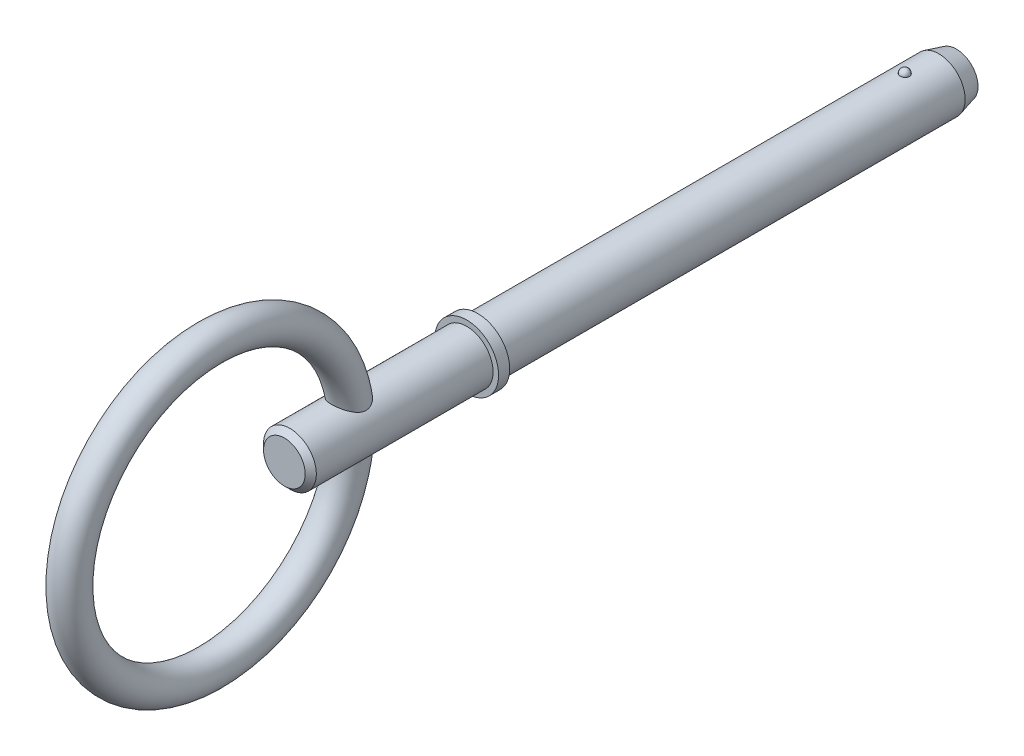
ISO-10303-21;
HEADER;
FILE_DESCRIPTION(('STEP AP214'),'2;1');
FILE_NAME('part.step','',(''),(''),'','','');
FILE_SCHEMA(('AUTOMOTIVE_DESIGN { 1 0 10303 214 1 1 1 1 }'));
ENDSEC;
DATA;
#1=APPLICATION_CONTEXT('core data for automotive mechanical design processes');
#2=APPLICATION_PROTOCOL_DEFINITION('international standard','automotive_design',2000,#1);
#3=PRODUCT_CONTEXT('',#1,'mechanical');
#4=PRODUCT('Part','Part','',(#3));
#5=PRODUCT_RELATED_PRODUCT_CATEGORY('part','',(#4));
#6=PRODUCT_DEFINITION_FORMATION('','',#4);
#7=PRODUCT_DEFINITION_CONTEXT('part definition',#1,'design');
#8=PRODUCT_DEFINITION('design','',#6,#7);
#9=PRODUCT_DEFINITION_SHAPE('','',#8);
#10=(LENGTH_UNIT() NAMED_UNIT(*) SI_UNIT(.MILLI.,.METRE.));
#11=(NAMED_UNIT(*) PLANE_ANGLE_UNIT() SI_UNIT($,.RADIAN.));
#12=(NAMED_UNIT(*) SI_UNIT($,.STERADIAN.) SOLID_ANGLE_UNIT());
#13=UNCERTAINTY_MEASURE_WITH_UNIT(LENGTH_MEASURE(1.E-05),#10,'distance_accuracy_value','');
#14=(GEOMETRIC_REPRESENTATION_CONTEXT(3) GLOBAL_UNCERTAINTY_ASSIGNED_CONTEXT((#13)) GLOBAL_UNIT_ASSIGNED_CONTEXT((#10,
#11,#12)) REPRESENTATION_CONTEXT('',''));
#15=CARTESIAN_POINT('',(0.,0.,0.));
#16=DIRECTION('',(0.,0.,1.));
#17=DIRECTION('',(1.,0.,0.));
#18=AXIS2_PLACEMENT_3D('',#15,#16,#17);
#19=CARTESIAN_POINT('',(0.,0.,38.1));
#20=DIRECTION('',(0.,0.,-1.));
#21=DIRECTION('',(-1.,0.,0.));
#22=AXIS2_PLACEMENT_3D('',#19,#20,#21);
#23=CYLINDRICAL_SURFACE('',#22,2.38);
#24=CARTESIAN_POINT('',(0.418361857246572,2.34294117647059,-0.419999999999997));
#25=CARTESIAN_POINT('',(0.418361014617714,2.34294160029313,-0.396453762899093));
#26=CARTESIAN_POINT('',(0.416399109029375,2.34329426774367,-0.372895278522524));
#27=CARTESIAN_POINT('',(0.408599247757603,2.34466666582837,-0.32643458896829));
#28=CARTESIAN_POINT('',(0.402757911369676,2.34568697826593,-0.303532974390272));
#29=CARTESIAN_POINT('',(0.387358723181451,2.3482789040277,-0.259059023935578));
#30=CARTESIAN_POINT('',(0.377802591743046,2.34985026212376,-0.237486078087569));
#31=CARTESIAN_POINT('',(0.355233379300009,2.35336760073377,-0.196270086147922));
#32=CARTESIAN_POINT('',(0.342220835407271,2.3553135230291,-0.176626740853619));
#33=CARTESIAN_POINT('',(0.313060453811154,2.35936636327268,-0.139777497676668));
#34=CARTESIAN_POINT('',(0.296906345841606,2.36147359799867,-0.122576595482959));
#35=CARTESIAN_POINT('',(0.26192116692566,2.36560920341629,-0.0911421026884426));
#36=CARTESIAN_POINT('',(0.243090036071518,2.36763757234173,-0.0769085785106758));
#37=CARTESIAN_POINT('',(0.203297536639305,2.37138533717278,-0.0518262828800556));
#38=CARTESIAN_POINT('',(0.182338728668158,2.37310509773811,-0.0409735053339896));
#39=CARTESIAN_POINT('',(0.138864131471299,2.37604521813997,-0.0229395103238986));
#40=CARTESIAN_POINT('',(0.116348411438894,2.37726560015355,-0.015758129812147));
#41=CARTESIAN_POINT('',(0.0705754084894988,2.37906276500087,-0.0053120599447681));
#42=CARTESIAN_POINT('',(0.0473247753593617,2.37964420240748,-0.00201903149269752));
#43=CARTESIAN_POINT('',(0.000593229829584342,2.38011460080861,0.000651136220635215));
#44=CARTESIAN_POINT('',(-0.0228876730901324,2.38000359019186,2.84360175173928E-05));
#45=CARTESIAN_POINT('',(-0.0692686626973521,2.37910422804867,-0.0050994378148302));
#46=CARTESIAN_POINT('',(-0.092171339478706,2.37831983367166,-0.00958192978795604));
#47=CARTESIAN_POINT('',(-0.136890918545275,2.37616546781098,-0.0222720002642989));
#48=CARTESIAN_POINT('',(-0.158707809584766,2.37479549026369,-0.0304796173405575));
#49=CARTESIAN_POINT('',(-0.200704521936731,2.37161607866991,-0.0504168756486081));
#50=CARTESIAN_POINT('',(-0.220879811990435,2.36980547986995,-0.0621558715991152));
#51=CARTESIAN_POINT('',(-0.258974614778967,2.36594575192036,-0.0888218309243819));
#52=CARTESIAN_POINT('',(-0.276894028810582,2.36389661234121,-0.103748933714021));
#53=CARTESIAN_POINT('',(-0.310124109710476,2.35976825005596,-0.136509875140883));
#54=CARTESIAN_POINT('',(-0.325413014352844,2.35768891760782,-0.154365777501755));
#55=CARTESIAN_POINT('',(-0.352793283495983,2.35374782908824,-0.192402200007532));
#56=CARTESIAN_POINT('',(-0.364884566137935,2.35188607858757,-0.212582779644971));
#57=CARTESIAN_POINT('',(-0.385587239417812,2.34858114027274,-0.254794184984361));
#58=CARTESIAN_POINT('',(-0.394183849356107,2.34713973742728,-0.276832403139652));
#59=CARTESIAN_POINT('',(-0.407590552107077,2.3448489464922,-0.322061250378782));
#60=CARTESIAN_POINT('',(-0.412400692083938,2.34399955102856,-0.34525186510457));
#61=CARTESIAN_POINT('',(-0.418098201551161,2.34299005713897,-0.392078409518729));
#62=CARTESIAN_POINT('',(-0.41899328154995,2.34282860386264,-0.415713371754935));
#63=CARTESIAN_POINT('',(-0.416857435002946,2.34320955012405,-0.462799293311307));
#64=CARTESIAN_POINT('',(-0.413826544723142,2.34375194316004,-0.486250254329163));
#65=CARTESIAN_POINT('',(-0.403929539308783,2.34547773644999,-0.532261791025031));
#66=CARTESIAN_POINT('',(-0.397069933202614,2.34666004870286,-0.554823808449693));
#67=CARTESIAN_POINT('',(-0.379705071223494,2.34953208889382,-0.59846383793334));
#68=CARTESIAN_POINT('',(-0.369199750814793,2.35122182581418,-0.619541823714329));
#69=CARTESIAN_POINT('',(-0.34479732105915,2.35492396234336,-0.659671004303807));
#70=CARTESIAN_POINT('',(-0.33089223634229,2.35693711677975,-0.678717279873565));
#71=CARTESIAN_POINT('',(-0.300080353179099,2.36105754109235,-0.714192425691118));
#72=CARTESIAN_POINT('',(-0.283173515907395,2.36316481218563,-0.730621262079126));
#73=CARTESIAN_POINT('',(-0.246801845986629,2.36723962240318,-0.760416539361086));
#74=CARTESIAN_POINT('',(-0.227334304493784,2.36920701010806,-0.773779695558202));
#75=CARTESIAN_POINT('',(-0.186398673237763,2.37277833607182,-0.797042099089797));
#76=CARTESIAN_POINT('',(-0.164930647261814,2.37438228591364,-0.806941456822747));
#77=CARTESIAN_POINT('',(-0.120727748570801,2.37703848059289,-0.82294821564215));
#78=CARTESIAN_POINT('',(-0.0980005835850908,2.37809374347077,-0.829076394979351));
#79=CARTESIAN_POINT('',(-0.051821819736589,2.37954782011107,-0.837451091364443));
#80=CARTESIAN_POINT('',(-0.0283702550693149,2.37994666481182,-0.839697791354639));
#81=CARTESIAN_POINT('',(0.0184023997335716,2.38004290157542,-0.840243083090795));
#82=CARTESIAN_POINT('',(0.0417231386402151,2.37974556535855,-0.838571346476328));
#83=CARTESIAN_POINT('',(0.0877471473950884,2.37849333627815,-0.831389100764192));
#84=CARTESIAN_POINT('',(0.110450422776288,2.37753844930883,-0.825878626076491));
#85=CARTESIAN_POINT('',(0.154584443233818,2.37507730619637,-0.811179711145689));
#86=CARTESIAN_POINT('',(0.17601599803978,2.37357140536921,-0.801993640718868));
#87=CARTESIAN_POINT('',(0.217028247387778,2.37017355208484,-0.780200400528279));
#88=CARTESIAN_POINT('',(0.236608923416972,2.36828159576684,-0.767593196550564));
#89=CARTESIAN_POINT('',(0.27351405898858,2.36430486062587,-0.739207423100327));
#90=CARTESIAN_POINT('',(0.290821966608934,2.36221883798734,-0.723407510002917));
#91=CARTESIAN_POINT('',(0.322554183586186,2.3580957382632,-0.689126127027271));
#92=CARTESIAN_POINT('',(0.336977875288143,2.35605867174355,-0.670644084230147));
#93=CARTESIAN_POINT('',(0.362636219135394,2.35224677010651,-0.63138169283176));
#94=CARTESIAN_POINT('',(0.373848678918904,2.35047379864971,-0.610586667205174));
#95=CARTESIAN_POINT('',(0.392641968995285,2.34740786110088,-0.567397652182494));
#96=CARTESIAN_POINT('',(0.400225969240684,2.34611447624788,-0.545005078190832));
#97=CARTESIAN_POINT('',(0.410033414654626,2.34441668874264,-0.505456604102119));
#98=CARTESIAN_POINT('',(0.413152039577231,2.34386644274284,-0.488523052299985));
#99=CARTESIAN_POINT('',(0.417316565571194,2.34312853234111,-0.454395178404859));
#100=CARTESIAN_POINT('',(0.418362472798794,2.34294086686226,-0.43720085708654));
#101=CARTESIAN_POINT('',(0.418361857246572,2.34294117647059,-0.419999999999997));
#102=B_SPLINE_CURVE_WITH_KNOTS('',3,(#24,#25,#26,#27,#28,#29,#30,#31,#32,#33,#34,#35,#36,#37,
#38,#39,#40,#41,#42,#43,#44,#45,#46,#47,#48,#49,#50,#51,#52,#53,#54,#55,#56,#57,#58,#59,#60,#61,
#62,#63,#64,#65,#66,#67,#68,#69,#70,#71,#72,#73,#74,#75,#76,#77,#78,#79,#80,#81,#82,#83,#84,#85,
#86,#87,#88,#89,#90,#91,#92,#93,#94,#95,#96,#97,#98,#99,#100,#101),.UNSPECIFIED.,.T.,.F.,(4,2,2,
2,2,2,2,2,2,2,2,2,2,2,2,2,2,2,2,2,2,2,2,2,2,2,2,2,2,2,2,2,2,2,2,2,2,2,4),(0.,0.0705763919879,
0.141214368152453,0.211819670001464,0.282414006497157,0.353150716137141,0.423889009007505,
0.494543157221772,0.565194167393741,0.635327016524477,0.705456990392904,0.77517764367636,
0.844899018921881,0.914806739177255,0.98471751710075,1.05518143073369,1.1256471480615,
1.19640787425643,1.26716771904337,1.33778814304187,1.40840791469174,1.47890799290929,
1.54940931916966,1.62007764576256,1.69074688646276,1.76149149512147,1.83223384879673,
1.90258285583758,1.97292854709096,2.04274328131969,2.11255738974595,2.18232655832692,
2.25209642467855,2.32234913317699,2.39261687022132,2.4633591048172,2.5340394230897,
2.58559662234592,2.63715366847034),.UNSPECIFIED.);
#103=CARTESIAN_POINT('',(0.418361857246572,2.34294117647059,-0.419999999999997));
#104=VERTEX_POINT('',#103);
#105=EDGE_CURVE('E102',#104,#104,#102,.T.);
#106=ORIENTED_EDGE('',*,*,#105,.T.);
#107=EDGE_LOOP('',(#106));
#108=FACE_BOUND('',#107,.T.);
#109=CARTESIAN_POINT('',(0.,0.,-3.49400000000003));
#110=DIRECTION('',(0.,0.,-1.));
#111=DIRECTION('',(-1.,0.,0.));
#112=AXIS2_PLACEMENT_3D('',#109,#110,#111);
#113=CIRCLE('',#112,2.38);
#114=CARTESIAN_POINT('',(-2.38,0.,-3.49400000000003));
#115=VERTEX_POINT('',#114);
#116=EDGE_CURVE('E109',#115,#115,#113,.F.);
#117=ORIENTED_EDGE('',*,*,#116,.T.);
#118=EDGE_LOOP('',(#117));
#119=FACE_BOUND('',#118,.T.);
#120=CARTESIAN_POINT('',(0.,0.,38.1));
#121=DIRECTION('',(0.,0.,1.));
#122=DIRECTION('',(1.,0.,0.));
#123=AXIS2_PLACEMENT_3D('',#120,#121,#122);
#124=CIRCLE('',#123,2.38);
#125=CARTESIAN_POINT('',(2.38,0.,38.1));
#126=VERTEX_POINT('',#125);
#127=EDGE_CURVE('E107',#126,#126,#124,.T.);
#128=ORIENTED_EDGE('',*,*,#127,.F.);
#129=EDGE_LOOP('',(#128));
#130=FACE_BOUND('',#129,.T.);
#131=ADVANCED_FACE('F39',(#108,#119,#130),#23,.T.);
#132=CARTESIAN_POINT('',(0.,0.,-5.08));
#133=DIRECTION('',(0.,0.,-1.));
#134=DIRECTION('',(-1.,0.,0.));
#135=AXIS2_PLACEMENT_3D('',#132,#133,#134);
#136=PLANE('',#135);
#137=CARTESIAN_POINT('',(0.,0.,-5.08));
#138=DIRECTION('',(0.,0.,-1.));
#139=DIRECTION('',(-1.,0.,0.));
#140=AXIS2_PLACEMENT_3D('',#137,#138,#139);
#141=CIRCLE('',#140,1.95503258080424);
#142=CARTESIAN_POINT('',(-1.95503258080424,0.,-5.08));
#143=VERTEX_POINT('',#142);
#144=EDGE_CURVE('E143',#143,#143,#141,.T.);
#145=ORIENTED_EDGE('',*,*,#144,.T.);
#146=EDGE_LOOP('',(#145));
#147=FACE_BOUND('',#146,.T.);
#148=ADVANCED_FACE('F88',(#147),#136,.T.);
#149=CARTESIAN_POINT('',(0.,0.,-5.08));
#150=DIRECTION('',(0.,0.,1.));
#151=DIRECTION('',(1.,0.,0.));
#152=AXIS2_PLACEMENT_3D('',#149,#150,#151);
#153=CONICAL_SURFACE('',#152,1.95503258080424,0.261799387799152);
#154=ORIENTED_EDGE('',*,*,#116,.F.);
#155=EDGE_LOOP('',(#154));
#156=FACE_BOUND('',#155,.T.);
#157=ORIENTED_EDGE('',*,*,#144,.F.);
#158=EDGE_LOOP('',(#157));
#159=FACE_BOUND('',#158,.T.);
#160=ADVANCED_FACE('F94',(#156,#159),#153,.T.);
#161=CARTESIAN_POINT('',(0.,2.38,-0.419999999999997));
#162=DIRECTION('',(0.,1.,0.));
#163=DIRECTION('',(0.,0.,1.));
#164=AXIS2_PLACEMENT_3D('',#161,#162,#163);
#165=SPHERICAL_SURFACE('',#164,0.419999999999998);
#166=ORIENTED_EDGE('',*,*,#105,.F.);
#167=EDGE_LOOP('',(#166));
#168=FACE_BOUND('',#167,.T.);
#169=ADVANCED_FACE('F112',(#168),#165,.T.);
#170=CARTESIAN_POINT('',(0.,0.,38.1));
#171=DIRECTION('',(0.,0.,-1.));
#172=DIRECTION('',(-1.,0.,0.));
#173=AXIS2_PLACEMENT_3D('',#170,#171,#172);
#174=PLANE('',#173);
#175=ORIENTED_EDGE('',*,*,#127,.T.);
#176=EDGE_LOOP('',(#175));
#177=FACE_BOUND('',#176,.T.);
#178=CARTESIAN_POINT('',(0.,0.,38.1));
#179=DIRECTION('',(0.,0.,-1.));
#180=DIRECTION('',(-1.,0.,0.));
#181=AXIS2_PLACEMENT_3D('',#178,#179,#180);
#182=CIRCLE('',#181,2.88);
#183=CARTESIAN_POINT('',(-2.88,0.,38.1));
#184=VERTEX_POINT('',#183);
#185=EDGE_CURVE('E108',#184,#184,#182,.T.);
#186=ORIENTED_EDGE('',*,*,#185,.T.);
#187=EDGE_LOOP('',(#186));
#188=FACE_BOUND('',#187,.T.);
#189=ADVANCED_FACE('F116',(#177,#188),#174,.T.);
#190=CARTESIAN_POINT('',(0.,0.,33.7287874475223));
#191=DIRECTION('',(0.,0.,-1.));
#192=DIRECTION('',(-1.,0.,0.));
#193=AXIS2_PLACEMENT_3D('',#190,#191,#192);
#194=CYLINDRICAL_SURFACE('',#193,2.88);
#195=CARTESIAN_POINT('',(0.,0.,39.1));
#196=DIRECTION('',(0.,0.,-1.));
#197=DIRECTION('',(-1.,0.,0.));
#198=AXIS2_PLACEMENT_3D('',#195,#196,#197);
#199=CIRCLE('',#198,2.88);
#200=CARTESIAN_POINT('',(-2.88,0.,39.1));
#201=VERTEX_POINT('',#200);
#202=EDGE_CURVE('E133',#201,#201,#199,.T.);
#203=ORIENTED_EDGE('',*,*,#202,.T.);
#204=EDGE_LOOP('',(#203));
#205=FACE_BOUND('',#204,.T.);
#206=ORIENTED_EDGE('',*,*,#185,.F.);
#207=EDGE_LOOP('',(#206));
#208=FACE_BOUND('',#207,.T.);
#209=ADVANCED_FACE('F120',(#205,#208),#194,.T.);
#210=CARTESIAN_POINT('',(0.,2.88,39.1));
#211=DIRECTION('',(0.,0.,1.));
#212=DIRECTION('',(1.,0.,0.));
#213=AXIS2_PLACEMENT_3D('',#210,#211,#212);
#214=PLANE('',#213);
#215=CARTESIAN_POINT('',(0.,0.,39.1));
#216=DIRECTION('',(0.,0.,1.));
#217=DIRECTION('',(1.,0.,0.));
#218=AXIS2_PLACEMENT_3D('',#215,#216,#217);
#219=CIRCLE('',#218,2.38);
#220=CARTESIAN_POINT('',(2.38,0.,39.1));
#221=VERTEX_POINT('',#220);
#222=EDGE_CURVE('E111',#221,#221,#219,.T.);
#223=ORIENTED_EDGE('',*,*,#222,.F.);
#224=EDGE_LOOP('',(#223));
#225=FACE_BOUND('',#224,.T.);
#226=ORIENTED_EDGE('',*,*,#202,.F.);
#227=EDGE_LOOP('',(#226));
#228=FACE_BOUND('',#227,.T.);
#229=ADVANCED_FACE('F85',(#225,#228),#214,.T.);
#230=CARTESIAN_POINT('',(0.,0.,55.55));
#231=DIRECTION('',(0.,0.,-1.));
#232=DIRECTION('',(-1.,0.,0.));
#233=AXIS2_PLACEMENT_3D('',#230,#231,#232);
#234=CYLINDRICAL_SURFACE('',#233,2.38);
#235=CARTESIAN_POINT('',(-0.903407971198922,-2.20187511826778,48.528101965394));
#236=CARTESIAN_POINT('',(-0.839710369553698,-2.22800560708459,48.4836275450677));
#237=CARTESIAN_POINT('',(-0.771955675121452,-2.25255828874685,48.4439200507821));
#238=CARTESIAN_POINT('',(-0.629623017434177,-2.29641711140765,48.3749006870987));
#239=CARTESIAN_POINT('',(-0.555034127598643,-2.31571464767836,48.3456058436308));
#240=CARTESIAN_POINT('',(-0.400673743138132,-2.34735542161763,48.2982943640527));
#241=CARTESIAN_POINT('',(-0.320887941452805,-2.35967847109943,48.2803104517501));
#242=CARTESIAN_POINT('',(-0.158738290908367,-2.37609587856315,48.2564617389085));
#243=CARTESIAN_POINT('',(-0.0763765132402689,-2.38019668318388,48.2505874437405));
#244=CARTESIAN_POINT('',(0.0836658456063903,-2.3797998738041,48.2511603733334));
#245=CARTESIAN_POINT('',(0.161351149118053,-2.37576936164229,48.2569382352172));
#246=CARTESIAN_POINT('',(0.314409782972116,-2.36039486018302,48.2792676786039));
#247=CARTESIAN_POINT('',(0.389782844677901,-2.34905002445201,48.2958205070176));
#248=CARTESIAN_POINT('',(0.535937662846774,-2.32006569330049,48.3390515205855));
#249=CARTESIAN_POINT('',(0.606735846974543,-2.30245039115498,48.3656908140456));
#250=CARTESIAN_POINT('',(0.742521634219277,-2.26231731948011,48.4283720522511));
#251=CARTESIAN_POINT('',(0.807508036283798,-2.23979853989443,48.4644159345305));
#252=CARTESIAN_POINT('',(0.935326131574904,-2.18966592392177,48.5483563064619));
#253=CARTESIAN_POINT('',(0.997591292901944,-2.16179128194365,48.5969595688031));
#254=CARTESIAN_POINT('',(1.11292144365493,-2.10474548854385,48.7035603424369));
#255=CARTESIAN_POINT('',(1.16597568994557,-2.07557287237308,48.7615686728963));
#256=CARTESIAN_POINT('',(1.26477130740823,-2.01699124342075,48.8902977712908));
#257=CARTESIAN_POINT('',(1.30983402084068,-1.98768494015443,48.9615920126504));
#258=CARTESIAN_POINT('',(1.38660631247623,-1.93491744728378,49.1129637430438));
#259=CARTESIAN_POINT('',(1.41834090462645,-1.91144534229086,49.1930244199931));
#260=CARTESIAN_POINT('',(1.46422131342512,-1.8764884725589,49.3506940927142));
#261=CARTESIAN_POINT('',(1.47990731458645,-1.86397592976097,49.4276190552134));
#262=CARTESIAN_POINT('',(1.49871691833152,-1.84889326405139,49.5838974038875));
#263=CARTESIAN_POINT('',(1.50185388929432,-1.84631256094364,49.6632481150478));
#264=CARTESIAN_POINT('',(1.4964844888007,-1.85065563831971,49.8088470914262));
#265=CARTESIAN_POINT('',(1.48970686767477,-1.85616871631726,49.8752204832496));
#266=CARTESIAN_POINT('',(1.46828795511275,-1.87315650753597,50.0059075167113));
#267=CARTESIAN_POINT('',(1.4536391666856,-1.88463690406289,50.0702191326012));
#268=CARTESIAN_POINT('',(1.40943250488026,-1.91806137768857,50.2230643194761));
#269=CARTESIAN_POINT('',(1.37616344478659,-1.94238425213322,50.3099991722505));
#270=CARTESIAN_POINT('',(1.29708737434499,-1.99605834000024,50.4763485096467));
#271=CARTESIAN_POINT('',(1.25125268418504,-2.02542060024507,50.555745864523));
#272=CARTESIAN_POINT('',(1.14695036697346,-2.08629729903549,50.7076285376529));
#273=CARTESIAN_POINT('',(1.08823347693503,-2.11784433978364,50.7799296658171));
#274=CARTESIAN_POINT('',(0.959228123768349,-2.17930599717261,50.9140708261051));
#275=CARTESIAN_POINT('',(0.888958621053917,-2.20922318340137,50.9759276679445));
#276=CARTESIAN_POINT('',(0.75336836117,-2.25851185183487,51.0749333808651));
#277=CARTESIAN_POINT('',(0.690173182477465,-2.27877299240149,51.1145392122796));
#278=CARTESIAN_POINT('',(0.557409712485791,-2.31482439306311,51.1839846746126));
#279=CARTESIAN_POINT('',(0.487846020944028,-2.33061784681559,51.2138312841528));
#280=CARTESIAN_POINT('',(0.342953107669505,-2.35631858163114,51.2620255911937));
#281=CARTESIAN_POINT('',(0.267574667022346,-2.36616750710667,51.280259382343));
#282=CARTESIAN_POINT('',(0.114199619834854,-2.37849775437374,51.3030468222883));
#283=CARTESIAN_POINT('',(0.036205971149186,-2.3809871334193,51.3076154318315));
#284=CARTESIAN_POINT('',(-0.107568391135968,-2.37849121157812,51.3030163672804));
#285=CARTESIAN_POINT('',(-0.173440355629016,-2.37456249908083,51.295790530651));
#286=CARTESIAN_POINT('',(-0.302853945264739,-2.36154811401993,51.2716908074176));
#287=CARTESIAN_POINT('',(-0.366395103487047,-2.35246141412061,51.2548149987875));
#288=CARTESIAN_POINT('',(-0.489880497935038,-2.32988758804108,51.2124346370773));
#289=CARTESIAN_POINT('',(-0.54981278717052,-2.31638670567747,51.1869031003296));
#290=CARTESIAN_POINT('',(-0.665021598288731,-2.28597979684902,51.1284893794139));
#291=CARTESIAN_POINT('',(-0.720295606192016,-2.26907194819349,51.0956032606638));
#292=CARTESIAN_POINT('',(-0.851132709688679,-2.22413718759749,51.0063110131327));
#293=CARTESIAN_POINT('',(-0.923680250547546,-2.19467168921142,50.9461969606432));
#294=CARTESIAN_POINT('',(-1.0572291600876,-2.13356097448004,50.8150668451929));
#295=CARTESIAN_POINT('',(-1.11820078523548,-2.1019104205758,50.7440235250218));
#296=CARTESIAN_POINT('',(-1.22894457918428,-2.03916543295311,50.5916118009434));
#297=CARTESIAN_POINT('',(-1.27853191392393,-2.0080868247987,50.5101025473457));
#298=CARTESIAN_POINT('',(-1.36422650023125,-1.95088121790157,50.3387530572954));
#299=CARTESIAN_POINT('',(-1.4003623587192,-1.92474376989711,50.2489310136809));
#300=CARTESIAN_POINT('',(-1.44943039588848,-1.88791548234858,50.0877392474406));
#301=CARTESIAN_POINT('',(-1.46600167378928,-1.87495651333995,50.0180059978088));
#302=CARTESIAN_POINT('',(-1.48984634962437,-1.8560704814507,49.8760551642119));
#303=CARTESIAN_POINT('',(-1.49713400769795,-1.85013263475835,49.803841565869));
#304=CARTESIAN_POINT('',(-1.5014924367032,-1.84660099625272,49.6583634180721));
#305=CARTESIAN_POINT('',(-1.49849436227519,-1.84906342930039,49.5850950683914));
#306=CARTESIAN_POINT('',(-1.48179888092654,-1.8624661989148,49.4405680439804));
#307=CARTESIAN_POINT('',(-1.46809860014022,-1.87340881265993,49.369309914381));
#308=CARTESIAN_POINT('',(-1.43218989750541,-1.90096973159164,49.2372815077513));
#309=CARTESIAN_POINT('',(-1.410850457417,-1.91699396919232,49.1761429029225));
#310=CARTESIAN_POINT('',(-1.36038958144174,-1.95312601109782,49.0584385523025));
#311=CARTESIAN_POINT('',(-1.33126141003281,-1.97323734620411,49.0018768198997));
#312=CARTESIAN_POINT('',(-1.26173108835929,-2.0185059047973,48.8870500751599));
#313=CARTESIAN_POINT('',(-1.22036168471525,-2.04397945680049,48.8294985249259));
#314=CARTESIAN_POINT('',(-1.1295425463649,-2.09553139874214,48.7216488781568));
#315=CARTESIAN_POINT('',(-1.08010424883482,-2.12160888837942,48.6713407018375));
#316=CARTESIAN_POINT('',(-0.987769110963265,-2.16578285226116,48.5904848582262));
#317=CARTESIAN_POINT('',(-0.946517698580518,-2.18419033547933,48.5582016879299));
#318=CARTESIAN_POINT('',(-0.903407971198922,-2.20187511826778,48.528101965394));
#319=B_SPLINE_CURVE_WITH_KNOTS('',3,(#235,#236,#237,#238,#239,#240,#241,#242,#243,#244,#245,
#246,#247,#248,#249,#250,#251,#252,#253,#254,#255,#256,#257,#258,#259,#260,#261,#262,#263,#264,
#265,#266,#267,#268,#269,#270,#271,#272,#273,#274,#275,#276,#277,#278,#279,#280,#281,#282,#283,
#284,#285,#286,#287,#288,#289,#290,#291,#292,#293,#294,#295,#296,#297,#298,#299,#300,#301,#302,
#303,#304,#305,#306,#307,#308,#309,#310,#311,#312,#313,#314,#315,#316,#317,#318),.UNSPECIFIED.,
.T.,.F.,(4,2,2,2,2,2,2,2,2,2,2,2,2,2,2,2,2,2,2,2,2,2,2,2,2,2,2,2,2,2,2,2,2,2,2,2,2,2,2,2,2,4),
(0.,0.245727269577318,0.491854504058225,0.738690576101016,0.985333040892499,1.21821047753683,
1.45111486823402,1.68313021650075,1.91519340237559,2.16541572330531,2.41592795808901,
2.68235417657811,2.94827811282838,3.18521517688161,3.42189976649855,3.62191159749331,
3.82211427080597,4.10918949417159,4.39690224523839,4.69076958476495,4.98415935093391,
5.21515577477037,5.44598665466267,5.67904815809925,5.91185441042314,6.11003726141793,
6.30825959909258,6.50710565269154,6.70605834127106,7.00062466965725,7.29593791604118,
7.59575158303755,7.89492395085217,8.11262207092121,8.32998539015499,8.54880641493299,
8.76768621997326,8.96702101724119,9.1665287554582,9.39164791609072,9.61645071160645,
9.78275580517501),.UNSPECIFIED.);
#320=CARTESIAN_POINT('',(-0.903407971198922,-2.20187511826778,48.528101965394));
#321=VERTEX_POINT('',#320);
#322=EDGE_CURVE('E10',#321,#321,#319,.T.);
#323=ORIENTED_EDGE('',*,*,#322,.F.);
#324=EDGE_LOOP('',(#323));
#325=FACE_BOUND('',#324,.T.);
#326=CARTESIAN_POINT('',(-0.903407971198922,2.20187511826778,48.528101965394));
#327=CARTESIAN_POINT('',(-0.970214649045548,2.17445928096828,48.5747550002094));
#328=CARTESIAN_POINT('',(-1.03268838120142,2.14525344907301,48.6267440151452));
#329=CARTESIAN_POINT('',(-1.1477077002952,2.0859961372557,48.7406478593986));
#330=CARTESIAN_POINT('',(-1.20022114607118,2.05594226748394,48.8025936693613));
#331=CARTESIAN_POINT('',(-1.29411550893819,1.99817720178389,48.9359266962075));
#332=CARTESIAN_POINT('',(-1.33544720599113,1.9704767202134,49.0073536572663));
#333=CARTESIAN_POINT('',(-1.40506760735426,1.92146090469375,49.1582024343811));
#334=CARTESIAN_POINT('',(-1.43339046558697,1.90012890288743,49.2376026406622));
#335=CARTESIAN_POINT('',(-1.47338334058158,1.86925714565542,49.3934496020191));
#336=CARTESIAN_POINT('',(-1.48649837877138,1.85870842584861,49.4693198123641));
#337=CARTESIAN_POINT('',(-1.50071746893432,1.8472518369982,49.62287045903));
#338=CARTESIAN_POINT('',(-1.50182784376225,1.84633889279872,49.7005499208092));
#339=CARTESIAN_POINT('',(-1.49326645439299,1.85325786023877,49.843985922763));
#340=CARTESIAN_POINT('',(-1.48506604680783,1.85989666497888,49.909904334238));
#341=CARTESIAN_POINT('',(-1.46099386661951,1.87886395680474,50.0394790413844));
#342=CARTESIAN_POINT('',(-1.44511553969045,1.8911973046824,50.1031333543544));
#343=CARTESIAN_POINT('',(-1.39754250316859,1.92678855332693,50.2561538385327));
#344=CARTESIAN_POINT('',(-1.36192725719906,1.95245999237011,50.3437372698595));
#345=CARTESIAN_POINT('',(-1.27788657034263,2.00847209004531,50.5109907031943));
#346=CARTESIAN_POINT('',(-1.22943137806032,2.03882352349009,50.5906417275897));
#347=CARTESIAN_POINT('',(-1.11958027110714,2.10119412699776,50.742420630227));
#348=CARTESIAN_POINT('',(-1.05794784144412,2.13323438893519,50.8143690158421));
#349=CARTESIAN_POINT('',(-0.922772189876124,2.19508493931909,50.9470807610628));
#350=CARTESIAN_POINT('',(-0.849252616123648,2.22489948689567,51.0078658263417));
#351=CARTESIAN_POINT('',(-0.710152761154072,2.27246326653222,51.1023110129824));
#352=CARTESIAN_POINT('',(-0.647015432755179,2.29138112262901,51.1389704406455));
#353=CARTESIAN_POINT('',(-0.514878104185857,2.32463484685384,51.2025884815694));
#354=CARTESIAN_POINT('',(-0.445882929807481,2.3389744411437,51.2295549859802));
#355=CARTESIAN_POINT('',(-0.302797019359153,2.36177853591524,51.2721624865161));
#356=CARTESIAN_POINT('',(-0.228666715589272,2.37019011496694,51.2877015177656));
#357=CARTESIAN_POINT('',(-0.0783799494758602,2.37989644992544,51.3056164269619));
#358=CARTESIAN_POINT('',(-0.0022252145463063,2.38119708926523,51.3080031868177));
#359=CARTESIAN_POINT('',(0.138818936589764,2.37685303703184,51.2999981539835));
#360=CARTESIAN_POINT('',(0.203841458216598,2.37212211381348,51.2912876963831));
#361=CARTESIAN_POINT('',(0.331347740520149,2.3576952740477,51.2645309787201));
#362=CARTESIAN_POINT('',(0.393830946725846,2.34799827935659,51.2464826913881));
#363=CARTESIAN_POINT('',(0.516206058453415,2.32419976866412,51.2016833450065));
#364=CARTESIAN_POINT('',(0.576015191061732,2.31000942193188,51.1747562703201));
#365=CARTESIAN_POINT('',(0.690806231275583,2.27831963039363,51.1136110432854));
#366=CARTESIAN_POINT('',(0.745785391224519,2.26081831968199,51.079388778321));
#367=CARTESIAN_POINT('',(0.876071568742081,2.21443701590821,50.9866108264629));
#368=CARTESIAN_POINT('',(0.948236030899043,2.18416686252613,50.924322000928));
#369=CARTESIAN_POINT('',(1.08068664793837,2.12176774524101,50.7888044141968));
#370=CARTESIAN_POINT('',(1.14094076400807,2.08963406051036,50.715547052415));
#371=CARTESIAN_POINT('',(1.24978363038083,2.02643655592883,50.558659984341));
#372=CARTESIAN_POINT('',(1.29819307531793,1.99539463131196,50.4748968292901));
#373=CARTESIAN_POINT('',(1.38094965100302,1.93904233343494,50.2989962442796));
#374=CARTESIAN_POINT('',(1.41533296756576,1.91371728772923,50.2068811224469));
#375=CARTESIAN_POINT('',(1.46011713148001,1.879629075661,50.043926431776));
#376=CARTESIAN_POINT('',(1.47459501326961,1.86818653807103,49.9747778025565));
#377=CARTESIAN_POINT('',(1.49436605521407,1.8524142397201,49.834403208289));
#378=CARTESIAN_POINT('',(1.49967306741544,1.84807375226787,49.7631805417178));
#379=CARTESIAN_POINT('',(1.50029887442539,1.84756805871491,49.6202291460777));
#380=CARTESIAN_POINT('',(1.49556248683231,1.8514480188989,49.548499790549));
#381=CARTESIAN_POINT('',(1.47581657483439,1.86722196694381,49.4073512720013));
#382=CARTESIAN_POINT('',(1.46080121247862,1.87912050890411,49.3379334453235));
#383=CARTESIAN_POINT('',(1.42246467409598,1.90827733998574,49.2082199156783));
#384=CARTESIAN_POINT('',(1.39980172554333,1.92509995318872,49.1476260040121));
#385=CARTESIAN_POINT('',(1.34679091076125,1.96255086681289,49.0311857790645));
#386=CARTESIAN_POINT('',(1.31644034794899,1.98318050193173,48.9753411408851));
#387=CARTESIAN_POINT('',(1.24396057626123,2.02954647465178,48.8614514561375));
#388=CARTESIAN_POINT('',(1.20077385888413,2.05559269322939,48.8042068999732));
#389=CARTESIAN_POINT('',(1.1061641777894,2.10801594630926,48.6971320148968));
#390=CARTESIAN_POINT('',(1.05473535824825,2.13439320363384,48.6473070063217));
#391=CARTESIAN_POINT('',(0.936202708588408,2.18924478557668,48.5487347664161));
#392=CARTESIAN_POINT('',(0.867904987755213,2.2174445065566,48.5012583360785));
#393=CARTESIAN_POINT('',(0.72291706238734,2.26885521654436,48.4177494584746));
#394=CARTESIAN_POINT('',(0.646227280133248,2.2920664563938,48.3817164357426));
#395=CARTESIAN_POINT('',(0.487515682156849,2.33094430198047,48.322591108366));
#396=CARTESIAN_POINT('',(0.405587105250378,2.34671524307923,48.2993190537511));
#397=CARTESIAN_POINT('',(0.237955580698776,2.36958127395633,48.2658521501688));
#398=CARTESIAN_POINT('',(0.152255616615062,2.37668309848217,48.2556471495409));
#399=CARTESIAN_POINT('',(-0.0122990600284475,2.38126478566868,48.2490505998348));
#400=CARTESIAN_POINT('',(-0.0910885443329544,2.37954037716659,48.2515167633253));
#401=CARTESIAN_POINT('',(-0.247004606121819,2.36843740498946,48.2675699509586));
#402=CARTESIAN_POINT('',(-0.324130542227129,2.35905594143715,48.2811611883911));
#403=CARTESIAN_POINT('',(-0.473048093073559,2.33371594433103,48.3185984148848));
#404=CARTESIAN_POINT('',(-0.544914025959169,2.31788812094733,48.3422409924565));
#405=CARTESIAN_POINT('',(-0.683201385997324,2.28095222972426,48.3990265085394));
#406=CARTESIAN_POINT('',(-0.749631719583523,2.25985303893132,48.4321534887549));
#407=CARTESIAN_POINT('',(-0.843767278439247,2.22565914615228,48.4880726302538));
#408=CARTESIAN_POINT('',(-0.874007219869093,2.21394047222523,48.5075705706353));
#409=CARTESIAN_POINT('',(-0.903407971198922,2.20187511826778,48.528101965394));
#410=B_SPLINE_CURVE_WITH_KNOTS('',3,(#326,#327,#328,#329,#330,#331,#332,#333,#334,#335,#336,
#337,#338,#339,#340,#341,#342,#343,#344,#345,#346,#347,#348,#349,#350,#351,#352,#353,#354,#355,
#356,#357,#358,#359,#360,#361,#362,#363,#364,#365,#366,#367,#368,#369,#370,#371,#372,#373,#374,
#375,#376,#377,#378,#379,#380,#381,#382,#383,#384,#385,#386,#387,#388,#389,#390,#391,#392,#393,
#394,#395,#396,#397,#398,#399,#400,#401,#402,#403,#404,#405,#406,#407,#408,#409),.UNSPECIFIED.,
.T.,.F.,(4,2,2,2,2,2,2,2,2,2,2,2,2,2,2,2,2,2,2,2,2,2,2,2,2,2,2,2,2,2,2,2,2,2,2,2,2,2,2,2,2,4),
(0.,0.257815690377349,0.516449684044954,0.776204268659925,1.03527292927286,1.26692758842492,
1.49846022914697,1.69794041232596,1.89759118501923,2.18993090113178,2.48295401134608,
2.78175997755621,3.07997865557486,3.30539912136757,3.53063565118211,3.75785831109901,
3.98489294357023,4.18128296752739,4.37771564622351,4.57830350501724,4.77900474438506,
5.07746482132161,5.37671714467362,5.68025255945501,5.98299985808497,6.19688795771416,
6.41045270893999,6.62519390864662,6.84005717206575,7.03981304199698,7.23963907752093,
7.46764796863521,7.69581957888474,7.95804669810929,8.22026062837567,8.47867938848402,
8.73689726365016,8.97226876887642,9.20772945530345,9.4386363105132,9.669156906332,
9.78261824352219),.UNSPECIFIED.);
#411=CARTESIAN_POINT('',(-0.903407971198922,2.20187511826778,48.528101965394));
#412=VERTEX_POINT('',#411);
#413=EDGE_CURVE('E51',#412,#412,#410,.T.);
#414=ORIENTED_EDGE('',*,*,#413,.F.);
#415=EDGE_LOOP('',(#414));
#416=FACE_BOUND('',#415,.T.);
#417=CARTESIAN_POINT('',(0.,0.,55.05));
#418=DIRECTION('',(0.,0.,-1.));
#419=DIRECTION('',(-1.,0.,0.));
#420=AXIS2_PLACEMENT_3D('',#417,#418,#419);
#421=CIRCLE('',#420,2.38);
#422=CARTESIAN_POINT('',(-2.38,0.,55.05));
#423=VERTEX_POINT('',#422);
#424=EDGE_CURVE('E64',#423,#423,#421,.T.);
#425=ORIENTED_EDGE('',*,*,#424,.T.);
#426=EDGE_LOOP('',(#425));
#427=FACE_BOUND('',#426,.T.);
#428=ORIENTED_EDGE('',*,*,#222,.T.);
#429=EDGE_LOOP('',(#428));
#430=FACE_BOUND('',#429,.T.);
#431=ADVANCED_FACE('F69',(#325,#416,#427,#430),#234,.T.);
#432=CARTESIAN_POINT('',(0.,0.,55.55));
#433=DIRECTION('',(0.,0.,-1.));
#434=DIRECTION('',(-1.,0.,0.));
#435=AXIS2_PLACEMENT_3D('',#432,#433,#434);
#436=PLANE('',#435);
#437=CARTESIAN_POINT('',(0.,0.,55.55));
#438=DIRECTION('',(0.,0.,-1.));
#439=DIRECTION('',(-1.,0.,0.));
#440=AXIS2_PLACEMENT_3D('',#437,#438,#439);
#441=CIRCLE('',#440,1.87999999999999);
#442=CARTESIAN_POINT('',(-1.87999999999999,0.,55.55));
#443=VERTEX_POINT('',#442);
#444=EDGE_CURVE('E58',#443,#443,#441,.F.);
#445=ORIENTED_EDGE('',*,*,#444,.T.);
#446=EDGE_LOOP('',(#445));
#447=FACE_BOUND('',#446,.T.);
#448=ADVANCED_FACE('F76',(#447),#436,.F.);
#449=CARTESIAN_POINT('',(0.,0.,55.05));
#450=DIRECTION('',(0.,0.,-1.));
#451=DIRECTION('',(-1.,0.,0.));
#452=AXIS2_PLACEMENT_3D('',#449,#450,#451);
#453=CONICAL_SURFACE('',#452,2.38,0.785398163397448);
#454=ORIENTED_EDGE('',*,*,#444,.F.);
#455=EDGE_LOOP('',(#454));
#456=FACE_BOUND('',#455,.T.);
#457=ORIENTED_EDGE('',*,*,#424,.F.);
#458=EDGE_LOOP('',(#457));
#459=FACE_BOUND('',#458,.T.);
#460=ADVANCED_FACE('F41',(#456,#459),#453,.T.);
#461=CARTESIAN_POINT('',(0.,0.,62.25));
#462=DIRECTION('',(1.,0.,0.));
#463=DIRECTION('',(0.,0.,-1.));
#464=AXIS2_PLACEMENT_3D('',#461,#462,#463);
#465=TOROIDAL_SURFACE('',#464,12.7,1.5);
#466=ORIENTED_EDGE('',*,*,#322,.T.);
#467=EDGE_LOOP('',(#466));
#468=FACE_BOUND('',#467,.T.);
#469=ORIENTED_EDGE('',*,*,#413,.T.);
#470=EDGE_LOOP('',(#469));
#471=FACE_BOUND('',#470,.T.);
#472=ADVANCED_FACE('F73',(#468,#471),#465,.T.);
#473=CLOSED_SHELL('',(#131,#148,#160,#169,#189,#209,#229,#431,#448,#460,#472));
#474=MANIFOLD_SOLID_BREP('B2',#473);
#475=ADVANCED_BREP_SHAPE_REPRESENTATION('',(#18,#474),#14);
#476=SHAPE_DEFINITION_REPRESENTATION(#9,#475);
ENDSEC;
END-ISO-10303-21;
